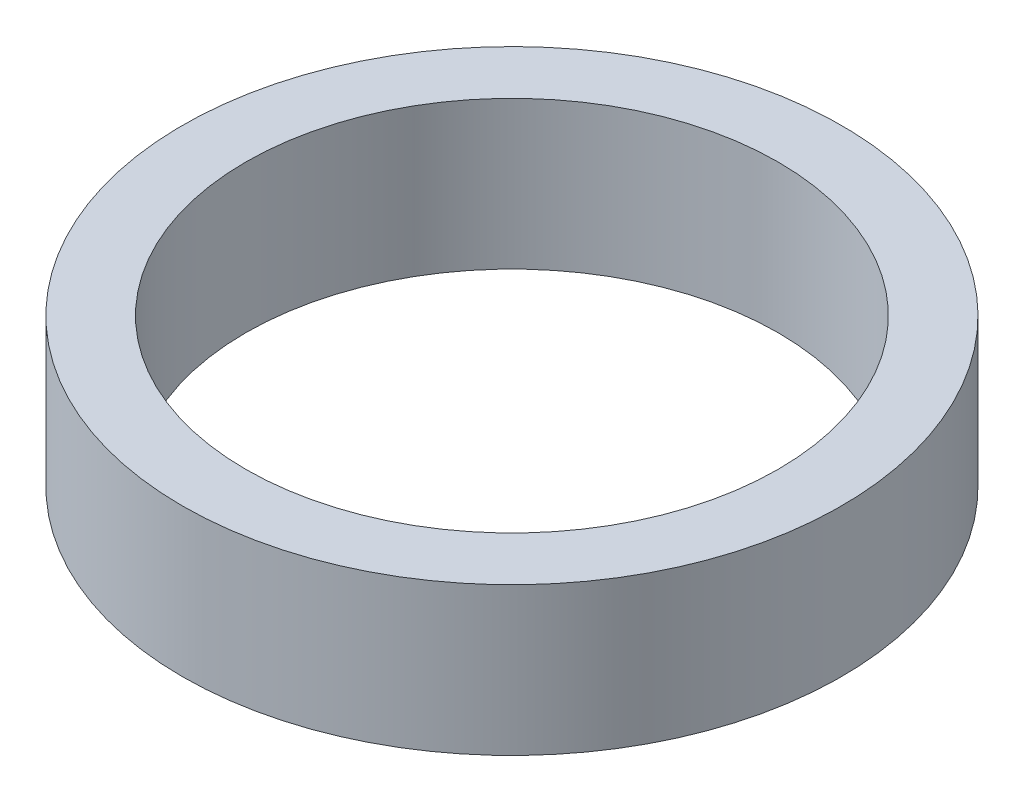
from build123d import *

# Parameters (mm, degrees)
ESQUISSE1_R        = 15.6
ESQUISSE1_R_2      = 12.6
BOSS_EXTRU_1_DEPTH = 7


with BuildPart() as part:
    # Esquisse1 → Boss.-Extru.1 (new body)
    with BuildSketch(Plane(origin=(0, 0, 0), x_dir=(1, 0, 0), z_dir=(0, 1, 0))):
        with Locations(Location((0, 0, 0), (0, 0, 270))):
            Circle(ESQUISSE1_R)
        with Locations(Location((0, 0, 0), (0, 0, 270))):
            Circle(ESQUISSE1_R_2, mode=Mode.SUBTRACT)
    extrude(amount=BOSS_EXTRU_1_DEPTH)


solid = part.part
